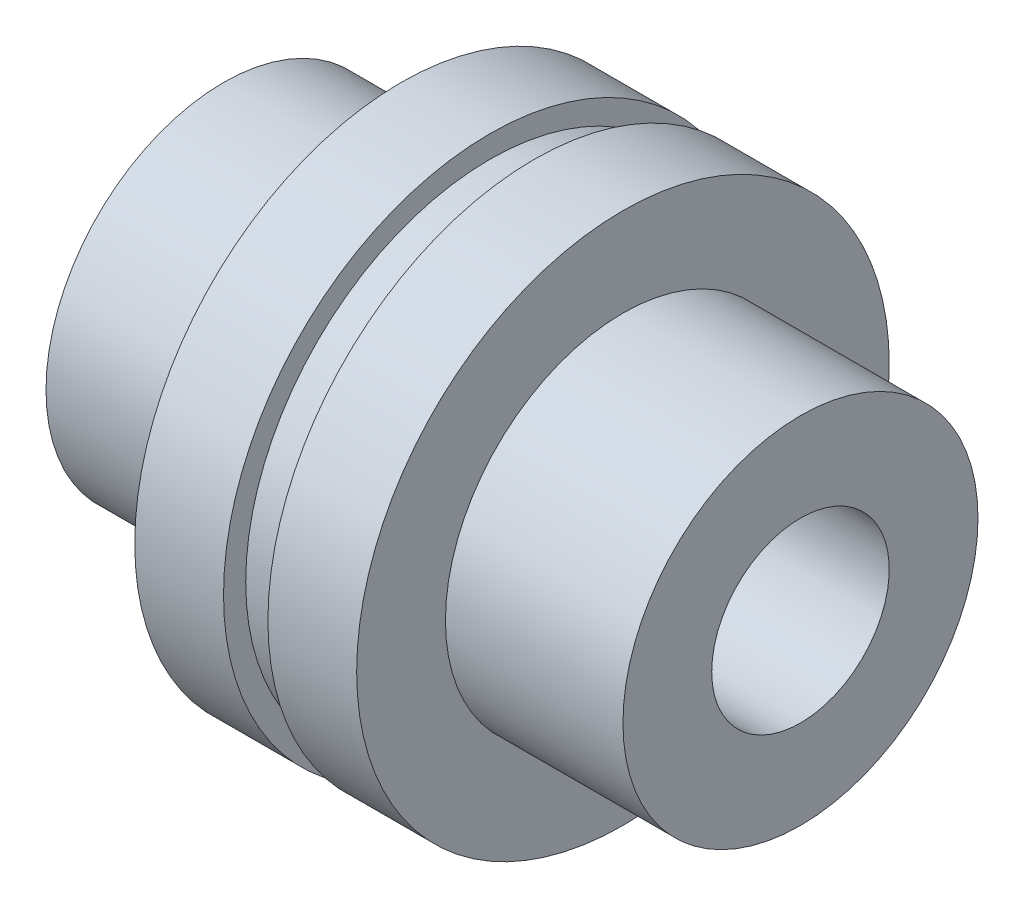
from build123d import *


with BuildPart() as part:
    # Sketch1 → Base-Revolve (revolve)
    with BuildSketch(Plane.XY, mode=Mode.PRIVATE) as base_revolve_sk:
        Polygon((0, 12.7), (0, 25.4), (25.4, 25.4), (25.4, 38.1), (38.1, 38.1), (38.1, 34.925), (44.45, 34.925), (44.45, 38.1), (57.15, 38.1), (57.15, 25.4), (82.55, 25.4), (82.55, 12.7), align=None)
    revolve(base_revolve_sk.sketch.rotate(Axis((0, 0, 0), (1, 0, 0)), 90), axis=Axis((0, 0, 0), (1, 0, 0)))


solid = part.part
